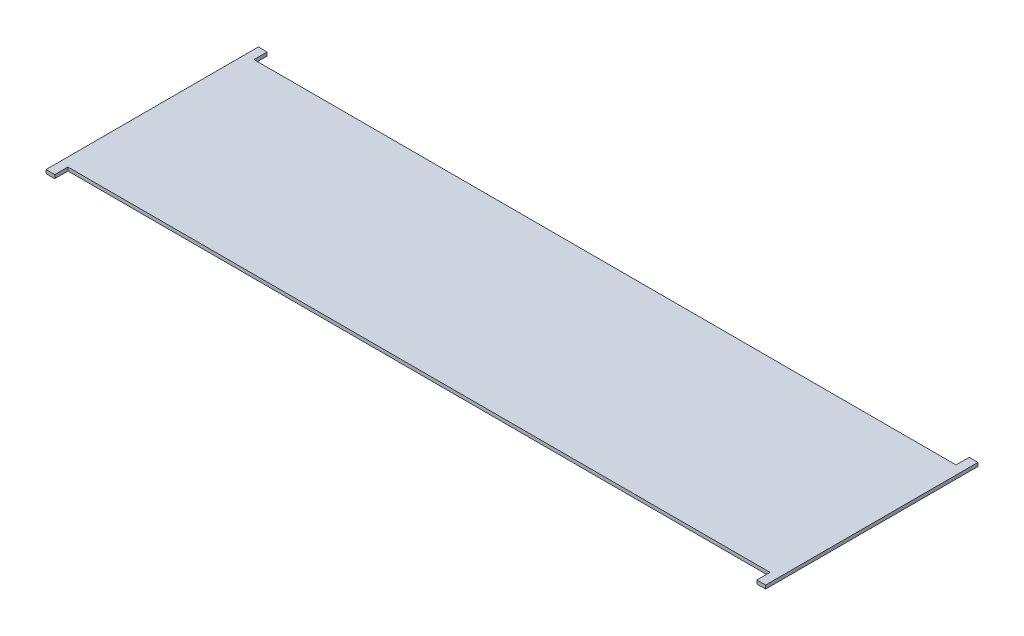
from build123d import *

# Parameters (mm, degrees)
BOSS_EXTRUDE1_DEPTH = 4


with BuildPart() as part:
    # Sketch1 → Boss-Extrude1 (new body)
    with BuildSketch(Plane(origin=(0, 3, 0), x_dir=(1, 0, 0), z_dir=(0, 1, 0))):
        Polygon((0, 212), (0, 0), (800, 0), (800, -15), (810, -15), (810, 227), (800, 227), (800, 212), align=None)
        Polygon((0, 212), (0, 0), (800, 0), (800, -15), (810, -15), (810, 227), (800, 227), (800, 212), align=None)
        Polygon((0, -15), (0, 0), (0, 212), (0, 227), (-10, 227), (-10, -15), align=None)
    extrude(amount=-BOSS_EXTRUDE1_DEPTH)


solid = part.part
